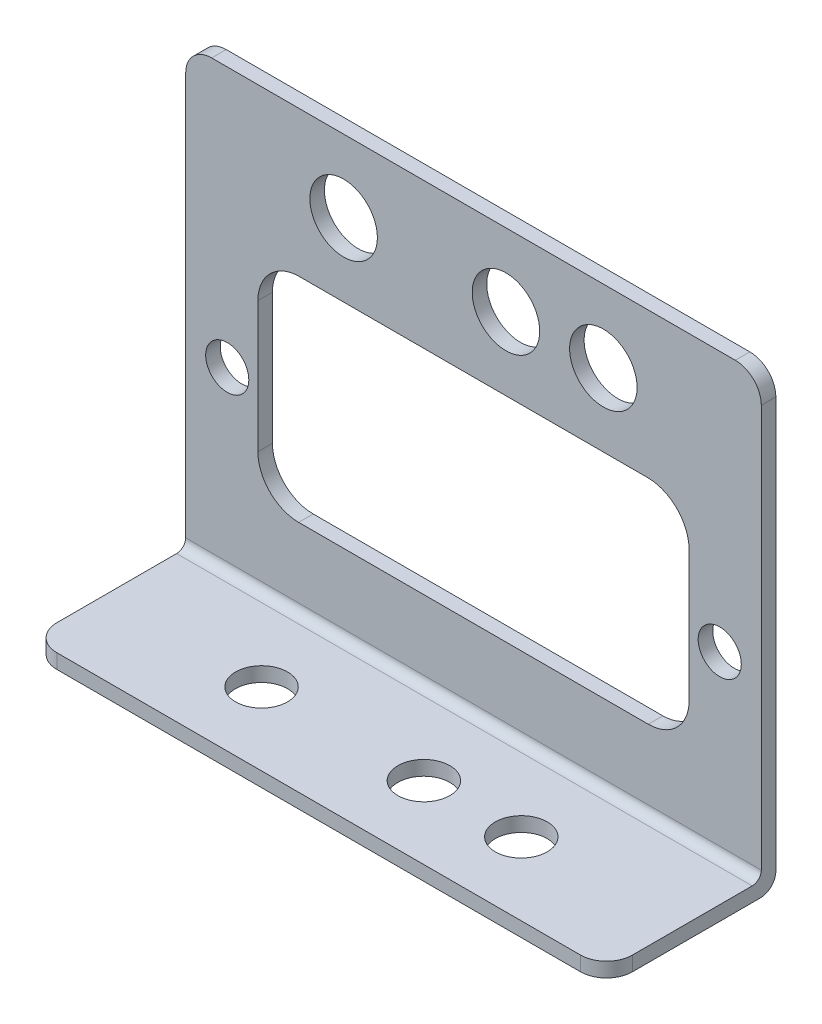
from build123d import *

# Parameters (mm, degrees)
BOSS_EXTRUDE1_DEPTH = 56.2864
SKETCH3_R           = 2.54
CUT_EXTRUDE2_DEPTH  = 73.623503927
CUT_EXTRUDE3_DEPTH  = 74.163257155
FILLET2_R           = 2.54
SKETCH6_R           = 2.1082
CUT_EXTRUDE4_DEPTH  = 74.163257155
SKETCH9_R           = 3.302
CUT_EXTRUDE5_DEPTH  = 2.54
FILLET3_R           = 2.54


with BuildPart() as part:
    # Sketch1 → Boss-Extrude1 (new body)
    with BuildSketch(Plane(origin=(0, 0, 0), x_dir=(0, 0, -1), z_dir=(1, 0, 0))):
        with BuildLine():
            Line((-1.524, 0), (-16.5608, 0))
            Line((-16.5608, 0), (-16.5608, 1.4224))
            Line((-16.5608, 1.4224), (-2.3114, 1.4224))
            ThreePointArc((-2.3114, 1.4224), (-1.682782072, 1.682782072), (-1.4224, 2.3114))
            Line((-1.4224, 2.3114), (-1.4224, 44.2214))
            Line((-1.4224, 44.2214), (0, 44.2214))
            Line((0, 44.2214), (0, 1.524))
            ThreePointArc((0, 1.524), (-0.446369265, 0.446369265), (-1.524, 0))
        make_face()
    extrude(amount=BOSS_EXTRUDE1_DEPTH)

    # Sketch3 → Cut-Extrude2 (cut, through all)
    with BuildSketch(Plane(origin=(0, 1.4224, 0), x_dir=(1, 0, 0), z_dir=(0, 1, 0))):
        with Locations(Location((15.4432, -9.4488, 0), (0, 0, 270))):
            Circle(SKETCH3_R)
        with Locations(Location((40.8432, -9.4488, 0), (0, 0, 270))):
            Circle(SKETCH3_R)
        with Locations(Location((31.3182, -9.4488, 0), (0, 0, 270))):
            Circle(SKETCH3_R)
    extrude(amount=-CUT_EXTRUDE2_DEPTH, mode=Mode.SUBTRACT)

    # Sketch4 → Cut-Extrude3 (cut, through all)
    with BuildSketch(Plane.XY.offset(1.4224)):
        with BuildLine():
            Line((7.0612, 13.1318), (7.0612, 25.9334))
            ThreePointArc((7.0612, 25.9334), (8.251518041, 28.807081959), (11.1252, 29.9974))
            Line((11.1252, 29.9974), (45.1612, 29.9974))
            ThreePointArc((45.1612, 29.9974), (48.034881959, 28.807081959), (49.2252, 25.9334))
            Line((49.2252, 25.9334), (49.2252, 13.1318))
            ThreePointArc((49.2252, 13.1318), (48.057200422, 10.311999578), (45.2374, 9.144))
            Line((45.2374, 9.144), (28.1432, 9.144))
            Line((28.1432, 9.144), (11.049, 9.144))
            ThreePointArc((11.049, 9.144), (8.229199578, 10.311999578), (7.0612, 13.1318))
        make_face()
    extrude(amount=-CUT_EXTRUDE3_DEPTH, mode=Mode.SUBTRACT)

    # Fillet2
    fillet2_edges = [part.edges().sort_by_distance(p)[0] for p in [
        (0, 0.7112, 16.5608),
        (56.2864, 0.7112, 16.5608),
    ]]
    fillet(fillet2_edges, radius=FILLET2_R)

    # Sketch6 → Cut-Extrude4 (cut, through all)
    with BuildSketch(Plane.XY.offset(1.4224)):
        with Locations((4.064, 18.7706)):
            Circle(SKETCH6_R)
        with Locations((52.2224, 18.7706)):
            Circle(SKETCH6_R)
    extrude(amount=-CUT_EXTRUDE4_DEPTH, mode=Mode.SUBTRACT)

    # Sketch9 → Cut-Extrude5 (cut)
    with BuildSketch(Plane.XY.offset(1.4224)):
        with Locations((15.4432, 37.1094)):
            Circle(SKETCH9_R)
        with Locations((31.3182, 37.1094)):
            Circle(SKETCH9_R)
        with Locations((40.8432, 37.1094)):
            Circle(SKETCH9_R)
    extrude(amount=-CUT_EXTRUDE5_DEPTH, mode=Mode.SUBTRACT)

    # Fillet3
    fillet3_edges = [part.edges().sort_by_distance(p)[0] for p in [
        (56.2864, 44.2214, 0.7112),
        (0, 44.2214, 0.7112),
    ]]
    fillet(fillet3_edges, radius=FILLET3_R)


solid = part.part
